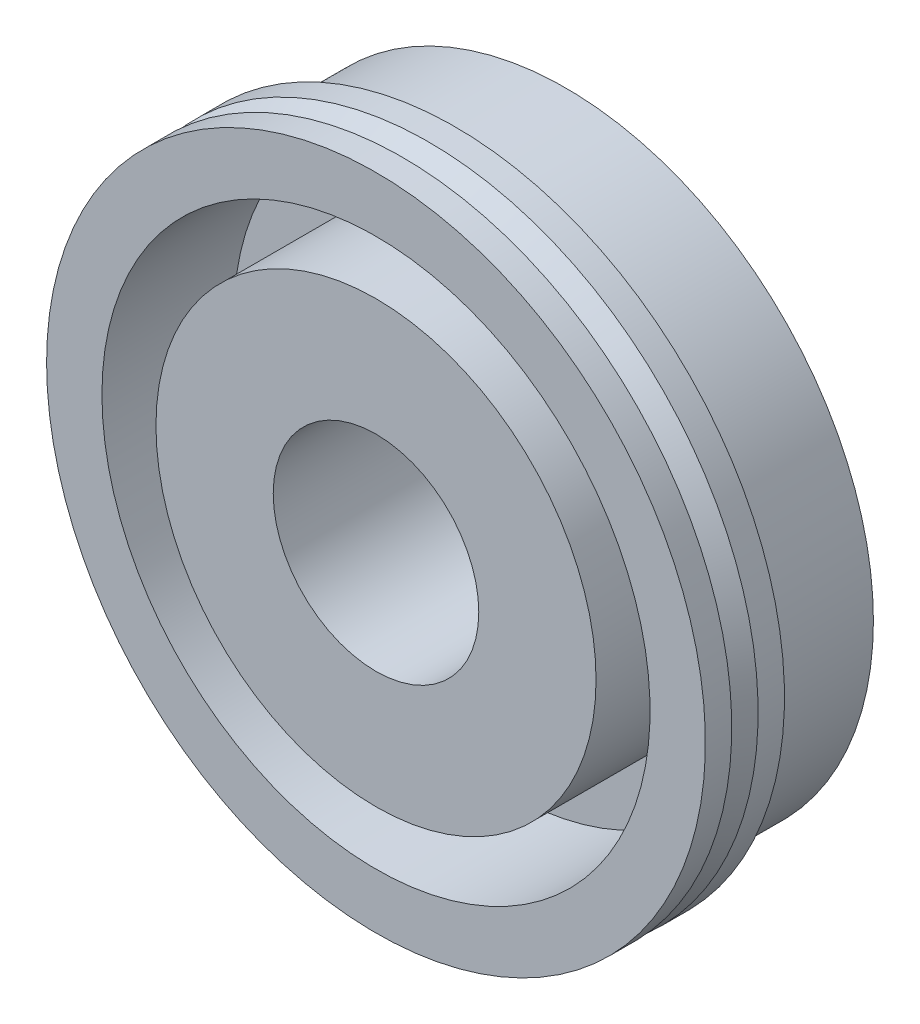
from build123d import *


with BuildPart() as part:
    # Esquisse1 → R_volution1 (revolve)
    with BuildSketch(Plane(origin=(0, 0, 0), x_dir=(0, 0, -1), z_dir=(1, 0, 0)), mode=Mode.PRIVATE) as r_volution1_sk:
        Polygon((0, 3.9), (0, 8.35), (5, 8.35), (5, 10.4), (0, 10.4), (0, 12.5), (1, 12.5), (1, 12), (2, 12.5), (3, 12.5), (3, 11.675), (7.2, 11.675), (7.2, 3.9), align=None)
    revolve(r_volution1_sk.sketch.rotate(Axis((0, 0, 0), (0, 0, 1)), 90), axis=Axis((0, 0, 0), (0, 0, 1)))


solid = part.part
